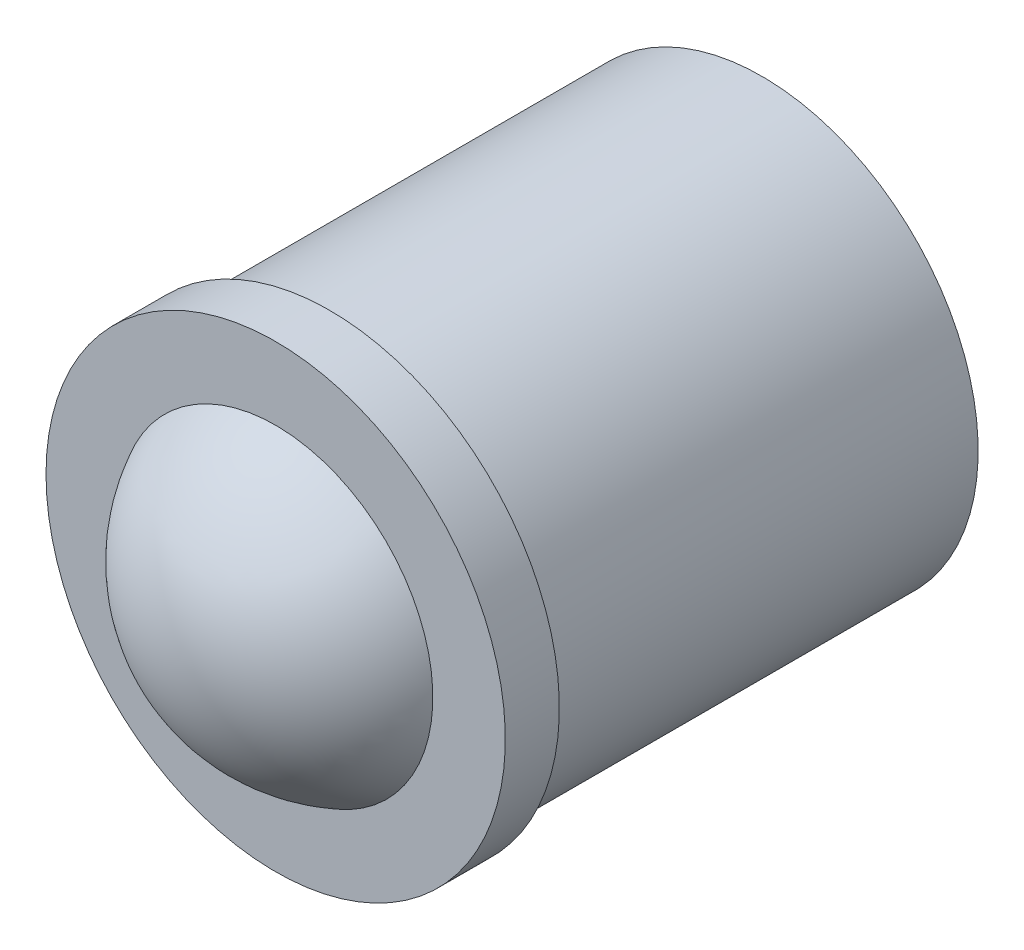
ISO-10303-21;
HEADER;
FILE_DESCRIPTION(('STEP AP214'),'2;1');
FILE_NAME('part.step','',(''),(''),'','','');
FILE_SCHEMA(('AUTOMOTIVE_DESIGN { 1 0 10303 214 1 1 1 1 }'));
ENDSEC;
DATA;
#1=APPLICATION_CONTEXT('core data for automotive mechanical design processes');
#2=APPLICATION_PROTOCOL_DEFINITION('international standard','automotive_design',2000,#1);
#3=PRODUCT_CONTEXT('',#1,'mechanical');
#4=PRODUCT('Part','Part','',(#3));
#5=PRODUCT_RELATED_PRODUCT_CATEGORY('part','',(#4));
#6=PRODUCT_DEFINITION_FORMATION('','',#4);
#7=PRODUCT_DEFINITION_CONTEXT('part definition',#1,'design');
#8=PRODUCT_DEFINITION('design','',#6,#7);
#9=PRODUCT_DEFINITION_SHAPE('','',#8);
#10=(LENGTH_UNIT() NAMED_UNIT(*) SI_UNIT(.MILLI.,.METRE.));
#11=(NAMED_UNIT(*) PLANE_ANGLE_UNIT() SI_UNIT($,.RADIAN.));
#12=(NAMED_UNIT(*) SI_UNIT($,.STERADIAN.) SOLID_ANGLE_UNIT());
#13=UNCERTAINTY_MEASURE_WITH_UNIT(LENGTH_MEASURE(1.E-05),#10,'distance_accuracy_value','');
#14=(GEOMETRIC_REPRESENTATION_CONTEXT(3) GLOBAL_UNCERTAINTY_ASSIGNED_CONTEXT((#13)) GLOBAL_UNIT_ASSIGNED_CONTEXT((#10,
#11,#12)) REPRESENTATION_CONTEXT('',''));
#15=CARTESIAN_POINT('',(0.,0.,0.));
#16=DIRECTION('',(0.,0.,1.));
#17=DIRECTION('',(1.,0.,0.));
#18=AXIS2_PLACEMENT_3D('',#15,#16,#17);
#19=CARTESIAN_POINT('',(0.,0.,-0.45));
#20=DIRECTION('',(-1.,0.,0.));
#21=DIRECTION('',(0.,0.,-1.));
#22=AXIS2_PLACEMENT_3D('',#19,#20,#21);
#23=SPHERICAL_SURFACE('',#22,3.25);
#24=CARTESIAN_POINT('',(0.,0.,-0.45));
#25=DIRECTION('',(0.,0.,1.));
#26=DIRECTION('',(-1.,0.,0.));
#27=AXIS2_PLACEMENT_3D('',#24,#25,#26);
#28=SPHERICAL_SURFACE('',#27,3.25);
#29=CARTESIAN_POINT('',(0.,0.,1.));
#30=DIRECTION('',(0.,0.,1.));
#31=DIRECTION('',(-1.,0.,0.));
#32=AXIS2_PLACEMENT_3D('',#29,#30,#31);
#33=CIRCLE('',#32,2.9086079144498);
#34=CARTESIAN_POINT('',(-2.9086079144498,0.,1.));
#35=VERTEX_POINT('',#34);
#36=EDGE_CURVE('E31',#35,#35,#33,.T.);
#37=ORIENTED_EDGE('',*,*,#36,.T.);
#38=EDGE_LOOP('',(#37));
#39=FACE_BOUND('',#38,.T.);
#40=ADVANCED_FACE('F12',(#39),#28,.T.);
#41=CARTESIAN_POINT('',(0.,0.,-8.));
#42=DIRECTION('',(0.,0.,1.));
#43=DIRECTION('',(-1.,0.,0.));
#44=AXIS2_PLACEMENT_3D('',#41,#42,#43);
#45=PLANE('',#44);
#46=CARTESIAN_POINT('',(0.,0.,-8.));
#47=DIRECTION('',(0.,0.,1.));
#48=DIRECTION('',(-1.,0.,0.));
#49=AXIS2_PLACEMENT_3D('',#46,#47,#48);
#50=CIRCLE('',#49,4.);
#51=CARTESIAN_POINT('',(-4.,0.,-8.));
#52=VERTEX_POINT('',#51);
#53=EDGE_CURVE('E8',#52,#52,#50,.T.);
#54=ORIENTED_EDGE('',*,*,#53,.F.);
#55=EDGE_LOOP('',(#54));
#56=FACE_BOUND('',#55,.T.);
#57=ADVANCED_FACE('F57',(#56),#45,.F.);
#58=CARTESIAN_POINT('',(0.,0.,3.));
#59=DIRECTION('',(0.,0.,1.));
#60=DIRECTION('',(-1.,0.,0.));
#61=AXIS2_PLACEMENT_3D('',#58,#59,#60);
#62=CYLINDRICAL_SURFACE('',#61,4.);
#63=CARTESIAN_POINT('',(0.,0.,0.));
#64=DIRECTION('',(0.,0.,1.));
#65=DIRECTION('',(-1.,0.,0.));
#66=AXIS2_PLACEMENT_3D('',#63,#64,#65);
#67=CIRCLE('',#66,4.);
#68=CARTESIAN_POINT('',(-4.,0.,0.));
#69=VERTEX_POINT('',#68);
#70=EDGE_CURVE('E18',#69,#69,#67,.T.);
#71=ORIENTED_EDGE('',*,*,#70,.F.);
#72=EDGE_LOOP('',(#71));
#73=FACE_BOUND('',#72,.T.);
#74=ORIENTED_EDGE('',*,*,#53,.T.);
#75=EDGE_LOOP('',(#74));
#76=FACE_BOUND('',#75,.T.);
#77=ADVANCED_FACE('F50',(#73,#76),#62,.T.);
#78=CARTESIAN_POINT('',(0.,-4.,0.));
#79=DIRECTION('',(0.,0.,1.));
#80=DIRECTION('',(-1.,0.,0.));
#81=AXIS2_PLACEMENT_3D('',#78,#79,#80);
#82=PLANE('',#81);
#83=CARTESIAN_POINT('',(0.,0.,0.));
#84=DIRECTION('',(0.,0.,1.));
#85=DIRECTION('',(-1.,0.,0.));
#86=AXIS2_PLACEMENT_3D('',#83,#84,#85);
#87=CIRCLE('',#86,4.25);
#88=CARTESIAN_POINT('',(-4.25,0.,0.));
#89=VERTEX_POINT('',#88);
#90=EDGE_CURVE('E22',#89,#89,#87,.T.);
#91=ORIENTED_EDGE('',*,*,#90,.F.);
#92=EDGE_LOOP('',(#91));
#93=FACE_BOUND('',#92,.T.);
#94=ORIENTED_EDGE('',*,*,#70,.T.);
#95=EDGE_LOOP('',(#94));
#96=FACE_BOUND('',#95,.T.);
#97=ADVANCED_FACE('F45',(#93,#96),#82,.F.);
#98=CARTESIAN_POINT('',(0.,0.,3.));
#99=DIRECTION('',(0.,0.,1.));
#100=DIRECTION('',(-1.,0.,0.));
#101=AXIS2_PLACEMENT_3D('',#98,#99,#100);
#102=CYLINDRICAL_SURFACE('',#101,4.25);
#103=CARTESIAN_POINT('',(0.,0.,1.));
#104=DIRECTION('',(0.,0.,1.));
#105=DIRECTION('',(-1.,0.,0.));
#106=AXIS2_PLACEMENT_3D('',#103,#104,#105);
#107=CIRCLE('',#106,4.25);
#108=CARTESIAN_POINT('',(-4.25,0.,1.));
#109=VERTEX_POINT('',#108);
#110=EDGE_CURVE('E26',#109,#109,#107,.T.);
#111=ORIENTED_EDGE('',*,*,#110,.F.);
#112=EDGE_LOOP('',(#111));
#113=FACE_BOUND('',#112,.T.);
#114=ORIENTED_EDGE('',*,*,#90,.T.);
#115=EDGE_LOOP('',(#114));
#116=FACE_BOUND('',#115,.T.);
#117=ADVANCED_FACE('F39',(#113,#116),#102,.T.);
#118=CARTESIAN_POINT('',(0.,-4.25,1.));
#119=DIRECTION('',(0.,0.,-1.));
#120=DIRECTION('',(1.,0.,0.));
#121=AXIS2_PLACEMENT_3D('',#118,#119,#120);
#122=PLANE('',#121);
#123=ORIENTED_EDGE('',*,*,#36,.F.);
#124=EDGE_LOOP('',(#123));
#125=FACE_BOUND('',#124,.T.);
#126=ORIENTED_EDGE('',*,*,#110,.T.);
#127=EDGE_LOOP('',(#126));
#128=FACE_BOUND('',#127,.T.);
#129=ADVANCED_FACE('F36',(#125,#128),#122,.F.);
#130=CLOSED_SHELL('',(#40,#57,#77,#97,#117,#129));
#131=MANIFOLD_SOLID_BREP('B1',#130);
#132=ADVANCED_BREP_SHAPE_REPRESENTATION('',(#18,#131),#14);
#133=SHAPE_DEFINITION_REPRESENTATION(#9,#132);
ENDSEC;
END-ISO-10303-21;
